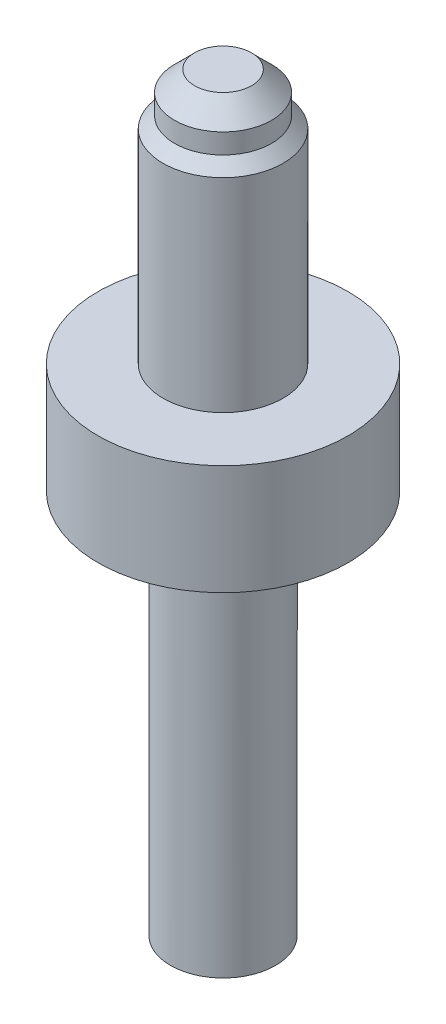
ISO-10303-21;
HEADER;
FILE_DESCRIPTION(('STEP AP214'),'2;1');
FILE_NAME('part.step','',(''),(''),'','','');
FILE_SCHEMA(('AUTOMOTIVE_DESIGN { 1 0 10303 214 1 1 1 1 }'));
ENDSEC;
DATA;
#1=APPLICATION_CONTEXT('core data for automotive mechanical design processes');
#2=APPLICATION_PROTOCOL_DEFINITION('international standard','automotive_design',2000,#1);
#3=PRODUCT_CONTEXT('',#1,'mechanical');
#4=PRODUCT('Part','Part','',(#3));
#5=PRODUCT_RELATED_PRODUCT_CATEGORY('part','',(#4));
#6=PRODUCT_DEFINITION_FORMATION('','',#4);
#7=PRODUCT_DEFINITION_CONTEXT('part definition',#1,'design');
#8=PRODUCT_DEFINITION('design','',#6,#7);
#9=PRODUCT_DEFINITION_SHAPE('','',#8);
#10=(LENGTH_UNIT() NAMED_UNIT(*) SI_UNIT(.MILLI.,.METRE.));
#11=(NAMED_UNIT(*) PLANE_ANGLE_UNIT() SI_UNIT($,.RADIAN.));
#12=(NAMED_UNIT(*) SI_UNIT($,.STERADIAN.) SOLID_ANGLE_UNIT());
#13=UNCERTAINTY_MEASURE_WITH_UNIT(LENGTH_MEASURE(1.E-05),#10,'distance_accuracy_value','');
#14=(GEOMETRIC_REPRESENTATION_CONTEXT(3) GLOBAL_UNCERTAINTY_ASSIGNED_CONTEXT((#13)) GLOBAL_UNIT_ASSIGNED_CONTEXT((#10,
#11,#12)) REPRESENTATION_CONTEXT('',''));
#15=CARTESIAN_POINT('',(0.,0.,0.));
#16=DIRECTION('',(0.,0.,1.));
#17=DIRECTION('',(1.,0.,0.));
#18=AXIS2_PLACEMENT_3D('',#15,#16,#17);
#19=CARTESIAN_POINT('',(0.,0.,0.));
#20=DIRECTION('',(0.,-1.,0.));
#21=DIRECTION('',(0.,0.,-1.));
#22=AXIS2_PLACEMENT_3D('',#19,#20,#21);
#23=CYLINDRICAL_SURFACE('',#22,6.);
#24=CARTESIAN_POINT('',(0.,20.35,0.));
#25=DIRECTION('',(0.,-1.,0.));
#26=DIRECTION('',(0.,0.,-1.));
#27=AXIS2_PLACEMENT_3D('',#24,#25,#26);
#28=CIRCLE('',#27,6.);
#29=CARTESIAN_POINT('',(0.,20.35,-6.));
#30=VERTEX_POINT('',#29);
#31=EDGE_CURVE('E35',#30,#30,#28,.T.);
#32=ORIENTED_EDGE('',*,*,#31,.T.);
#33=EDGE_LOOP('',(#32));
#34=FACE_BOUND('',#33,.T.);
#35=CARTESIAN_POINT('',(0.,0.,0.));
#36=DIRECTION('',(0.,-1.,0.));
#37=DIRECTION('',(0.,0.,-1.));
#38=AXIS2_PLACEMENT_3D('',#35,#36,#37);
#39=CIRCLE('',#38,6.);
#40=CARTESIAN_POINT('',(0.,0.,-6.));
#41=VERTEX_POINT('',#40);
#42=EDGE_CURVE('E27',#41,#41,#39,.T.);
#43=ORIENTED_EDGE('',*,*,#42,.F.);
#44=EDGE_LOOP('',(#43));
#45=FACE_BOUND('',#44,.T.);
#46=ADVANCED_FACE('F12',(#34,#45),#23,.T.);
#47=CARTESIAN_POINT('',(6.,0.,0.));
#48=DIRECTION('',(0.,1.,0.));
#49=DIRECTION('',(0.,0.,1.));
#50=AXIS2_PLACEMENT_3D('',#47,#48,#49);
#51=PLANE('',#50);
#52=ORIENTED_EDGE('',*,*,#42,.T.);
#53=EDGE_LOOP('',(#52));
#54=FACE_BOUND('',#53,.T.);
#55=CARTESIAN_POINT('',(0.,0.,0.));
#56=DIRECTION('',(0.,-1.,0.));
#57=DIRECTION('',(0.,0.,-1.));
#58=AXIS2_PLACEMENT_3D('',#55,#56,#57);
#59=CIRCLE('',#58,12.5);
#60=CARTESIAN_POINT('',(0.,0.,-12.5));
#61=VERTEX_POINT('',#60);
#62=EDGE_CURVE('E32',#61,#61,#59,.T.);
#63=ORIENTED_EDGE('',*,*,#62,.F.);
#64=EDGE_LOOP('',(#63));
#65=FACE_BOUND('',#64,.T.);
#66=ADVANCED_FACE('F53',(#54,#65),#51,.T.);
#67=CARTESIAN_POINT('',(0.,0.,0.));
#68=DIRECTION('',(0.,-1.,0.));
#69=DIRECTION('',(0.,0.,-1.));
#70=AXIS2_PLACEMENT_3D('',#67,#68,#69);
#71=CYLINDRICAL_SURFACE('',#70,12.5);
#72=ORIENTED_EDGE('',*,*,#62,.T.);
#73=EDGE_LOOP('',(#72));
#74=FACE_BOUND('',#73,.T.);
#75=CARTESIAN_POINT('',(0.,-11.,0.));
#76=DIRECTION('',(0.,-1.,0.));
#77=DIRECTION('',(0.,0.,-1.));
#78=AXIS2_PLACEMENT_3D('',#75,#76,#77);
#79=CIRCLE('',#78,12.5);
#80=CARTESIAN_POINT('',(0.,-11.,-12.5));
#81=VERTEX_POINT('',#80);
#82=EDGE_CURVE('E44',#81,#81,#79,.T.);
#83=ORIENTED_EDGE('',*,*,#82,.F.);
#84=EDGE_LOOP('',(#83));
#85=FACE_BOUND('',#84,.T.);
#86=ADVANCED_FACE('F50',(#74,#85),#71,.T.);
#87=CARTESIAN_POINT('',(0.,21.5,0.));
#88=DIRECTION('',(0.,-1.,0.));
#89=DIRECTION('',(0.,0.,-1.));
#90=AXIS2_PLACEMENT_3D('',#87,#88,#89);
#91=CONICAL_SURFACE('',#90,4.85,0.785398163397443);
#92=ORIENTED_EDGE('',*,*,#31,.F.);
#93=EDGE_LOOP('',(#92));
#94=FACE_BOUND('',#93,.T.);
#95=CARTESIAN_POINT('',(0.,21.5,0.));
#96=DIRECTION('',(0.,-1.,0.));
#97=DIRECTION('',(0.,0.,-1.));
#98=AXIS2_PLACEMENT_3D('',#95,#96,#97);
#99=CIRCLE('',#98,4.85);
#100=CARTESIAN_POINT('',(0.,21.5,-4.85));
#101=VERTEX_POINT('',#100);
#102=EDGE_CURVE('E38',#101,#101,#99,.T.);
#103=ORIENTED_EDGE('',*,*,#102,.T.);
#104=EDGE_LOOP('',(#103));
#105=FACE_BOUND('',#104,.T.);
#106=ADVANCED_FACE('F52',(#94,#105),#91,.T.);
#107=CARTESIAN_POINT('',(0.,0.,0.));
#108=DIRECTION('',(0.,-1.,0.));
#109=DIRECTION('',(0.,0.,-1.));
#110=AXIS2_PLACEMENT_3D('',#107,#108,#109);
#111=CYLINDRICAL_SURFACE('',#110,4.85);
#112=CARTESIAN_POINT('',(0.,23.5,0.));
#113=DIRECTION('',(0.,1.,0.));
#114=DIRECTION('',(0.,0.,1.));
#115=AXIS2_PLACEMENT_3D('',#112,#113,#114);
#116=CIRCLE('',#115,4.85);
#117=CARTESIAN_POINT('',(0.,23.5,4.85));
#118=VERTEX_POINT('',#117);
#119=EDGE_CURVE('E23',#118,#118,#116,.F.);
#120=ORIENTED_EDGE('',*,*,#119,.T.);
#121=EDGE_LOOP('',(#120));
#122=FACE_BOUND('',#121,.T.);
#123=ORIENTED_EDGE('',*,*,#102,.F.);
#124=EDGE_LOOP('',(#123));
#125=FACE_BOUND('',#124,.T.);
#126=ADVANCED_FACE('F61',(#122,#125),#111,.T.);
#127=CARTESIAN_POINT('',(0.,25.5,0.));
#128=DIRECTION('',(0.,1.,0.));
#129=DIRECTION('',(0.,0.,1.));
#130=AXIS2_PLACEMENT_3D('',#127,#128,#129);
#131=PLANE('',#130);
#132=CARTESIAN_POINT('',(0.,25.5,0.));
#133=DIRECTION('',(0.,1.,0.));
#134=DIRECTION('',(0.,0.,1.));
#135=AXIS2_PLACEMENT_3D('',#132,#133,#134);
#136=CIRCLE('',#135,2.85);
#137=CARTESIAN_POINT('',(0.,25.5,2.85));
#138=VERTEX_POINT('',#137);
#139=EDGE_CURVE('E19',#138,#138,#136,.T.);
#140=ORIENTED_EDGE('',*,*,#139,.T.);
#141=EDGE_LOOP('',(#140));
#142=FACE_BOUND('',#141,.T.);
#143=ADVANCED_FACE('F80',(#142),#131,.T.);
#144=CARTESIAN_POINT('',(0.,23.5,0.));
#145=DIRECTION('',(0.,-1.,0.));
#146=DIRECTION('',(0.,0.,-1.));
#147=AXIS2_PLACEMENT_3D('',#144,#145,#146);
#148=CONICAL_SURFACE('',#147,4.85,0.78539816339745);
#149=ORIENTED_EDGE('',*,*,#139,.F.);
#150=EDGE_LOOP('',(#149));
#151=FACE_BOUND('',#150,.T.);
#152=ORIENTED_EDGE('',*,*,#119,.F.);
#153=EDGE_LOOP('',(#152));
#154=FACE_BOUND('',#153,.T.);
#155=ADVANCED_FACE('F14',(#151,#154),#148,.T.);
#156=CARTESIAN_POINT('',(0.,-49.5,0.));
#157=DIRECTION('',(0.,-1.,0.));
#158=DIRECTION('',(0.,0.,-1.));
#159=AXIS2_PLACEMENT_3D('',#156,#157,#158);
#160=PLANE('',#159);
#161=CARTESIAN_POINT('',(0.,-49.5,0.));
#162=DIRECTION('',(0.,-1.,0.));
#163=DIRECTION('',(1.,0.,0.));
#164=AXIS2_PLACEMENT_3D('',#161,#162,#163);
#165=CIRCLE('',#164,5.25);
#166=CARTESIAN_POINT('',(5.25,-49.5,0.));
#167=VERTEX_POINT('',#166);
#168=EDGE_CURVE('E41',#167,#167,#165,.T.);
#169=ORIENTED_EDGE('',*,*,#168,.T.);
#170=EDGE_LOOP('',(#169));
#171=FACE_BOUND('',#170,.T.);
#172=ADVANCED_FACE('F87',(#171),#160,.T.);
#173=CARTESIAN_POINT('',(0.,0.,0.));
#174=DIRECTION('',(0.,1.,0.));
#175=DIRECTION('',(-1.,0.,0.));
#176=AXIS2_PLACEMENT_3D('',#173,#174,#175);
#177=CYLINDRICAL_SURFACE('',#176,5.25);
#178=CARTESIAN_POINT('',(0.,-11.,0.));
#179=DIRECTION('',(0.,1.,0.));
#180=DIRECTION('',(-1.,0.,0.));
#181=AXIS2_PLACEMENT_3D('',#178,#179,#180);
#182=CIRCLE('',#181,5.25);
#183=CARTESIAN_POINT('',(-5.25,-11.,0.));
#184=VERTEX_POINT('',#183);
#185=EDGE_CURVE('E8',#184,#184,#182,.F.);
#186=ORIENTED_EDGE('',*,*,#185,.T.);
#187=EDGE_LOOP('',(#186));
#188=FACE_BOUND('',#187,.T.);
#189=ORIENTED_EDGE('',*,*,#168,.F.);
#190=EDGE_LOOP('',(#189));
#191=FACE_BOUND('',#190,.T.);
#192=ADVANCED_FACE('F90',(#188,#191),#177,.T.);
#193=CARTESIAN_POINT('',(0.,-11.,0.));
#194=DIRECTION('',(0.,1.,0.));
#195=DIRECTION('',(-1.,0.,0.));
#196=AXIS2_PLACEMENT_3D('',#193,#194,#195);
#197=PLANE('',#196);
#198=ORIENTED_EDGE('',*,*,#185,.F.);
#199=EDGE_LOOP('',(#198));
#200=FACE_BOUND('',#199,.T.);
#201=ORIENTED_EDGE('',*,*,#82,.T.);
#202=EDGE_LOOP('',(#201));
#203=FACE_BOUND('',#202,.T.);
#204=ADVANCED_FACE('F48',(#200,#203),#197,.F.);
#205=CLOSED_SHELL('',(#46,#66,#86,#106,#126,#143,#155,#172,#192,#204));
#206=MANIFOLD_SOLID_BREP('B1',#205);
#207=ADVANCED_BREP_SHAPE_REPRESENTATION('',(#18,#206),#14);
#208=SHAPE_DEFINITION_REPRESENTATION(#9,#207);
ENDSEC;
END-ISO-10303-21;
